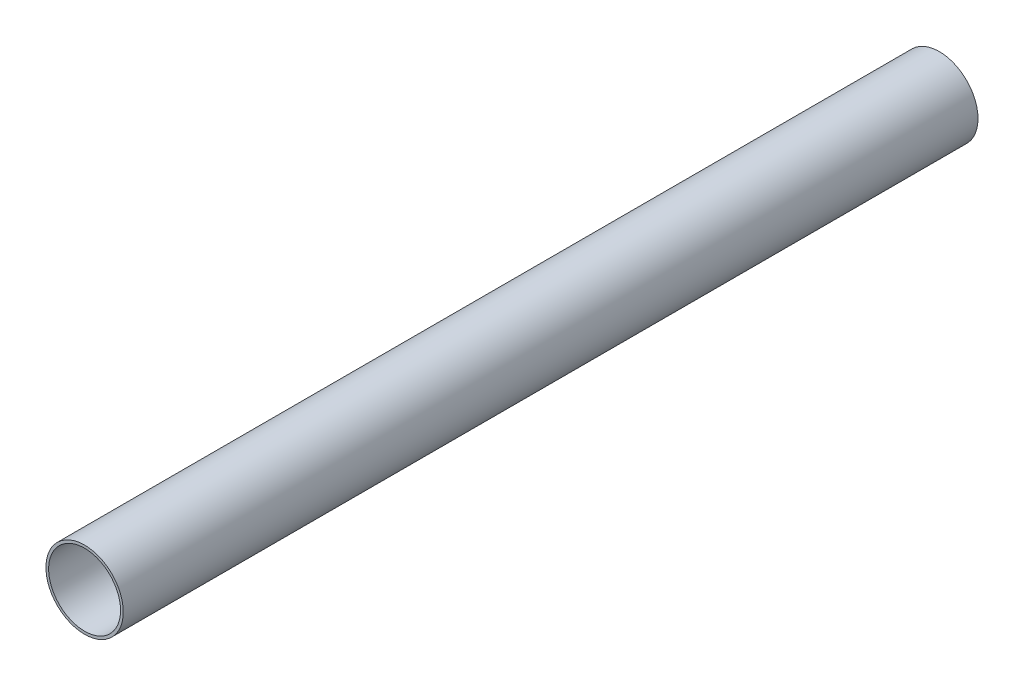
from build123d import *

# Parameters (mm, degrees)
SKETCH1_R      = 29.083
SKETCH1_R_2    = 27.051
EXTRUDE3_DEPTH = 642.9375


with BuildPart() as part:
    # Sketch1 → Extrude3 (new body)
    with BuildSketch(Plane.XY):
        Circle(SKETCH1_R)
        Circle(SKETCH1_R_2, mode=Mode.SUBTRACT)
    extrude(amount=EXTRUDE3_DEPTH)


solid = part.part
